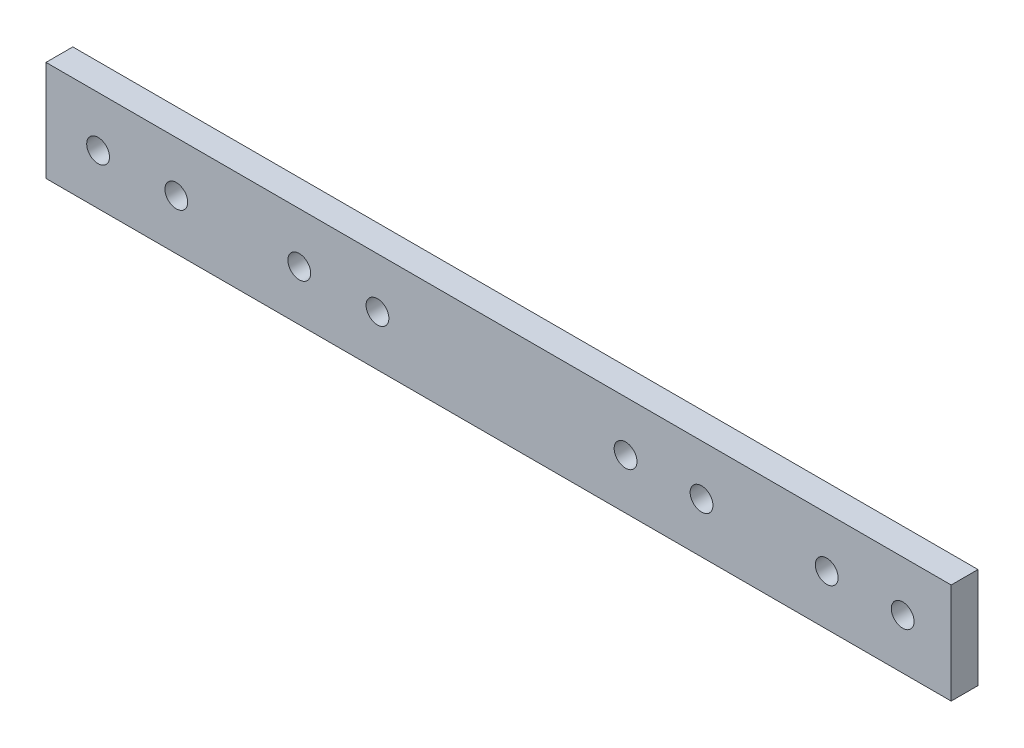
from build123d import *

# Parameters (mm, degrees)
ESQUISSE1_W       = 270
ESQUISSE1_H       = 30
EXTRUSION1_DEPTH  = 8
TROU_TARAUD_M81_D = 6.8


with BuildPart() as part:
    # Esquisse1 → Extrusion1 (new body)
    with BuildSketch(Plane.XY):
        Rectangle(ESQUISSE1_W, ESQUISSE1_H)
    extrude(amount=EXTRUSION1_DEPTH)

    # Trou taraud_ M81 (through all)
    with Locations(Plane(origin=(-119.464274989, 0, 8), x_dir=(1, 0, 0), z_dir=(0, 0, 1))):
        with Locations((0, 0), (23.339491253, 0), (60, 0), (83.339491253, 0), (157.339491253, 0), (180, 0), (217.339491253, 0), (240, 0)):
            Hole(TROU_TARAUD_M81_D / 2)


solid = part.part
